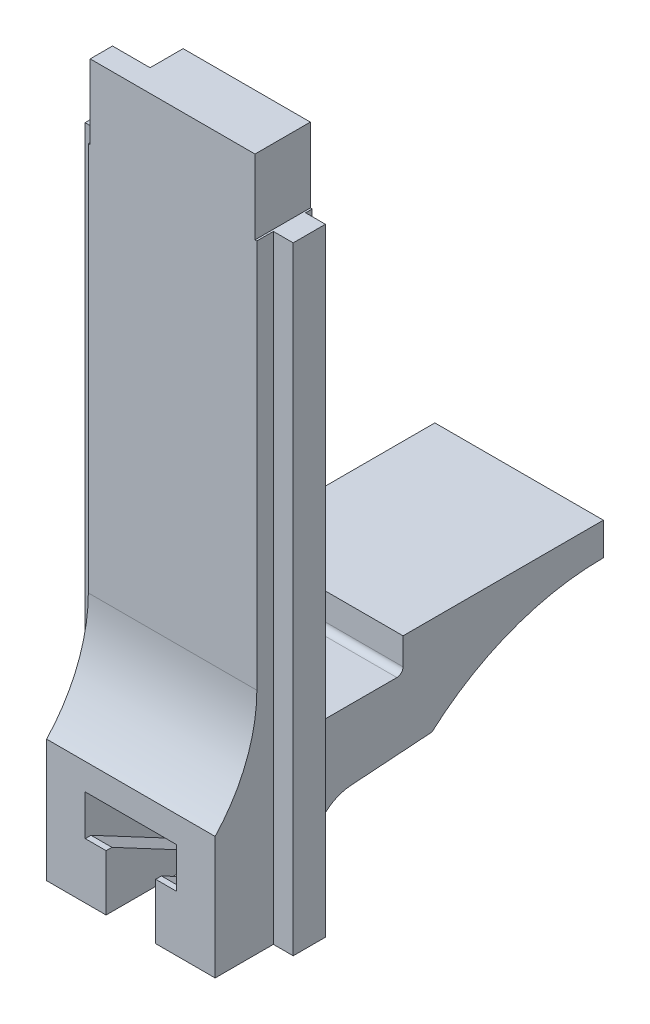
from build123d import *

# Parameters (mm, degrees)
EXTRUDE_1_DEPTH     = 5.1816
SKETCH_2_W          = 12.8016
SKETCH_2_H          = 1.9812
EXTRUDE_2_DEPTH     = 42.545
SKETCH_3_W          = 23.876
SKETCH_3_H          = 5.9182
CUT_EXTRUDE_1_DEPTH = 1.524
CUT_EXTRUDE_2_DEPTH = 2.8067
SKETCH_7_W          = 1.3335
SKETCH_7_H          = 4.572
CUT_EXTRUDE_4_DEPTH = 47.60158704
CUT_EXTRUDE_START   = 38.1
CUT_EXTRUDE_3_DEPTH = 2.7432
SKETCH_9_W          = 2.3114
SKETCH_9_H          = 4.445
CUT_EXTRUDE_5_DEPTH = 2.032


with BuildPart() as part:
    # Sketch 1 → Extrude 1 (new, symmetric)
    with BuildSketch(Plane(origin=(0, 0, 0), x_dir=(0, 0, -1), z_dir=(1, 0, 0))):
        with BuildLine():
            Line((0, 0), (-5.969, 0))
            Line((-5.969, 0), (-5.969, 7.540625))
            ThreePointArc((-5.969, 7.540625), (-4.068131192, 10.548284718), (-3.4036, 14.04366989))
            Line((-3.4036, 14.04366989), (-3.4036, 42.545))
            Line((-3.4036, 42.545), (0, 42.545))
            Line((0, 42.545), (0, 10.795))
            ThreePointArc((0, 10.795), (0.111592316, 10.525592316), (0.381, 10.414))
            Line((0.381, 10.414), (5.207, 10.414))
            ThreePointArc((5.207, 10.414), (5.476407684, 10.525592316), (5.588, 10.795))
            Line((5.588, 10.795), (5.588, 12.446))
            Line((5.588, 12.446), (17.907, 12.446))
            Line((17.907, 12.446), (17.907, 10.4394))
            ThreePointArc((17.907, 10.4394), (12.267895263, 9.404080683), (7.364321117, 6.433163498))
            Line((7.364321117, 6.433163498), (2.362818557, 6.083424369))
            ThreePointArc((2.362818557, 6.083424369), (0.682361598, 5.281887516), (0, 3.549611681))
            Line((0, 3.549611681), (0, 0))
        make_face()
    extrude(amount=EXTRUDE_1_DEPTH, both=True)

    # Sketch 2 → Extrude 2 (add)
    with BuildSketch(Plane.XZ):
        with Locations((0, 1.397)):
            Rectangle(SKETCH_2_W, SKETCH_2_H)
    extrude(amount=-EXTRUDE_2_DEPTH)

    # Sketch 3 → Cut-Extrude 1 (cut, symmetric)
    with BuildSketch(Plane(origin=(0, 0, 0), x_dir=(0, 0, -1), z_dir=(1, 0, 0))):
        with Locations((5.969, 2.9591)):
            Rectangle(SKETCH_3_W, SKETCH_3_H)
    extrude(amount=CUT_EXTRUDE_1_DEPTH, both=True, mode=Mode.SUBTRACT)

    # Sketch 4 → Cut-Extrude 2 (cut, symmetric)
    with BuildSketch(Plane(origin=(0, 0, 0), x_dir=(0, 0, -1), z_dir=(1, 0, 0))):
        Polygon((-5.969, 5.9182), (-5.969, 3.429), (-5.613379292, 3.429), (-0.4064, 0.6604), (17.907, 0.6604), (17.907, 5.9182), align=None)
    extrude(amount=CUT_EXTRUDE_2_DEPTH, both=True, mode=Mode.SUBTRACT)

    # Sketch 7 → Cut-Extrude 4 (cut, through all)
    with BuildSketch(Plane(origin=(0, 0, 0), x_dir=(-1, 0, 0), z_dir=(0, 0, -1))):
        with Locations((-5.73405, 40.259)):
            Rectangle(SKETCH_7_W, SKETCH_7_H)
        with Locations((5.73405, 40.259)):
            Rectangle(SKETCH_7_W, SKETCH_7_H)
    extrude(amount=-CUT_EXTRUDE_4_DEPTH, mode=Mode.SUBTRACT)

    # Sketch 5 → Cut-Extrude 3 (cut)
    with BuildSketch(Plane(origin=(0, 0, 0), x_dir=(1, 0, 0), z_dir=(0, 1, 0)).offset(CUT_EXTRUDE_START)):
        with BuildLine():
            Line((-0.066429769, -2.032), (-6.4008, -2.032))
            Line((-6.4008, -2.032), (-6.4008, 0))
            Line((-6.4008, 0), (4.2291, 0))
            ThreePointArc((4.2291, 0), (2.309522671, -1.498375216), (-0.066429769, -2.032))
        make_face()
    extrude(amount=CUT_EXTRUDE_3_DEPTH, mode=Mode.SUBTRACT)

    # Sketch 9 → Cut-Extrude 5 (cut)
    with BuildSketch(Plane(origin=(0, 0, 0), x_dir=(-1, 0, 0), z_dir=(0, 0, -1))):
        with Locations((3.9116, 40.3225)):
            Rectangle(SKETCH_9_W, SKETCH_9_H)
    extrude(amount=-CUT_EXTRUDE_5_DEPTH, mode=Mode.SUBTRACT)


solid = part.part
